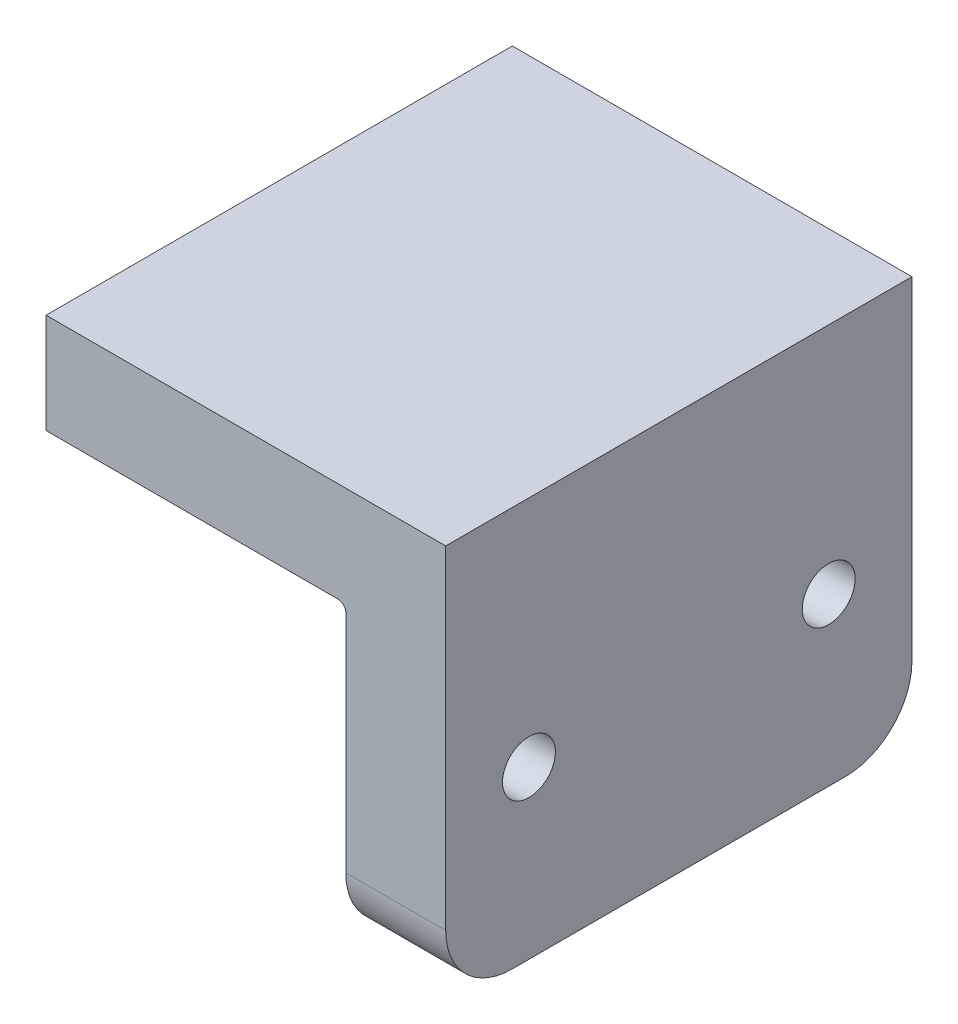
from build123d import *

# Parameters (mm, degrees)
EXTRUDE1_DEPTH                                   = 44.45
FILLET1_R                                        = 1.524
CBORE_FOR_3_8_SOCKET_HEAD_CAP_SCREW1_D           = 10.0838
CBORE_FOR_3_8_SOCKET_HEAD_CAP_SCREW1_CBORE_D     = 15.875
CBORE_FOR_3_8_SOCKET_HEAD_CAP_SCREW1_CBORE_DEPTH = 9.525
FILLET2_R                                        = 12.7
SKETCH4_W                                        = 2.645833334
SKETCH4_H                                        = 0.474893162
CUT_EXTRUDE1_DEPTH                               = 0.762
SKETCH5_W                                        = 11.248792
SKETCH5_H                                        = 37.761150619
EXTRUDE2_DEPTH                                   = 9.906


with BuildPart() as part:
    # Sketch1 → Extrude1 (new, symmetric)
    with BuildSketch(Plane.XY):
        Polygon((-76.2, 0), (-76.2, -19.05), (-19.05, -19.05), (-19.05, -76.2), (0, -76.2), (0, 0), align=None)
    extrude(amount=EXTRUDE1_DEPTH, both=True)

    # Fillet1
    fillet1_edges = [part.edges().sort_by_distance(p)[0] for p in [
        (-19.05, -19.05, 0),
    ]]
    fillet(fillet1_edges, radius=FILLET1_R)

    # CBORE for 3_8 Socket Head Cap Screw1 (through all)
    with Locations(Plane.ZY.offset(19.05)):
        with Locations((-28.575, -44.45), (28.575, -44.45)):
            CounterBoreHole(CBORE_FOR_3_8_SOCKET_HEAD_CAP_SCREW1_D / 2, CBORE_FOR_3_8_SOCKET_HEAD_CAP_SCREW1_CBORE_D / 2, CBORE_FOR_3_8_SOCKET_HEAD_CAP_SCREW1_CBORE_DEPTH)

    # Fillet2
    fillet2_edges = [part.edges().sort_by_distance(p)[0] for p in [
        (-9.525, -76.2, 44.45),
        (-9.525, -76.2, -44.45),
    ]]
    fillet(fillet2_edges, radius=FILLET2_R)

    # Sketch4 → Cut-Extrude1 (cut)
    # profile 1 of 27: a face of its own
    with BuildSketch(Plane.XZ.offset(76.2)):
        with BuildLine():
            Line((-11.817006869, -29.627642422), (-11.817006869, -29.097627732))
            add(Edge.make_bspline(
                [(-11.817006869, -29.097627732), (-11.816851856, -29.062997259), (-11.816552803, -28.996187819), (-11.812926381, -28.899843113), (-11.806427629, -28.810960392), (-11.798396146, -28.72956013), (-11.787136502, -28.655675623), (-11.774227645, -28.58921491), (-11.758502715, -28.530162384), (-11.739831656, -28.477857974), (-11.717838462, -28.430901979), (-11.694347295, -28.386518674), (-11.666502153, -28.345376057), (-11.63631017, -28.306508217), (-11.603143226, -28.270209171), (-11.567132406, -28.236209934), (-11.527754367, -28.204860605), (-11.485280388, -28.176357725), (-11.44057521, -28.150487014), (-11.393536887, -28.127888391), (-11.344096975, -28.109556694), (-11.292573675, -28.094178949), (-11.238969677, -28.081827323), (-11.18295519, -28.073605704), (-11.124921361, -28.068021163), (-11.085423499, -28.067528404), (-11.065446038, -28.067279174)],
                knots=[0, 0, 0, 0, 1.698787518, 3.27731721, 4.728409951, 6.070286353, 7.288646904, 8.393455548, 9.389990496, 10.283725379, 11.113616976, 11.931887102, 12.744353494, 13.547053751, 14.344590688, 15.153907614, 15.974148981, 16.810666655, 17.660988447, 18.506082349, 19.367288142, 20.244738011, 21.142497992, 22.06302001, 23.020302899, 24, 24, 24, 24], degree=3))
            add(Edge.make_bspline(
                [(-11.065446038, -28.067279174), (-11.04334545, -28.067639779), (-10.999915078, -28.068348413), (-10.936251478, -28.075295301), (-10.875554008, -28.087162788), (-10.817310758, -28.102672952), (-10.76248009, -28.124300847), (-10.709753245, -28.149009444), (-10.660610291, -28.179409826), (-10.614429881, -28.214143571), (-10.570861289, -28.252089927), (-10.531070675, -28.294088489), (-10.495069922, -28.339644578), (-10.461302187, -28.387493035), (-10.432471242, -28.439605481), (-10.40557821, -28.494157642), (-10.382790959, -28.552522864), (-10.370830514, -28.593134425), (-10.364766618, -28.61372432)],
                knots=[0, 0, 0, 0, 1.101964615, 2.165495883, 3.188506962, 4.184641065, 5.166448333, 6.124117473, 7.085225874, 8.042124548, 9.003636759, 9.963451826, 10.9225791, 11.897800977, 12.880319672, 13.889154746, 14.929810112, 16, 16, 16, 16], degree=3))
            add(Edge.make_bspline(
                [(-10.364766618, -28.61372432), (-10.361392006, -28.627287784), (-10.35408151, -28.656670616), (-10.346659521, -28.705291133), (-10.339835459, -28.761321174), (-10.333971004, -28.82494192), (-10.329984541, -28.89619005), (-10.32687129, -28.974996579), (-10.324607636, -29.061397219), (-10.324527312, -29.121476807), (-10.324485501, -29.15274926)],
                knots=[0, 0, 0, 0, 0.618981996, 1.340914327, 2.176866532, 3.120127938, 4.170906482, 5.338178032, 6.614476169, 8, 8, 8, 8], degree=3))
            Line((-10.324485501, -29.15274926), (-9.171173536, -29.15274926))
            Line((-9.171173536, -29.15274926), (-9.171173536, -29.627642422))
            Line((-9.171173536, -29.627642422), (-11.817006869, -29.627642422))
        make_face()
        with BuildLine():
            Line((-10.799378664, -29.15274926), (-10.799378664, -28.984734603))
            add(Edge.make_bspline(
                [(-10.799378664, -28.984734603), (-10.799572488, -28.954161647), (-10.799929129, -28.897906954), (-10.805087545, -28.821083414), (-10.812963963, -28.759345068), (-10.824264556, -28.710574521), (-10.841403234, -28.672054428), (-10.861264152, -28.638870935), (-10.886340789, -28.610172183), (-10.915477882, -28.585850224), (-10.948300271, -28.566086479), (-10.984720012, -28.552193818), (-11.024217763, -28.543433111), (-11.051794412, -28.542600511), (-11.065976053, -28.542172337)],
                knots=[0, 0, 0, 0, 1.862197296, 3.426470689, 4.686743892, 5.65255712, 6.462325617, 7.244961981, 8.000258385, 8.771939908, 9.549006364, 10.32248703, 11.137317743, 12, 12, 12, 12], degree=3))
            add(Edge.make_bspline(
                [(-11.065976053, -28.542172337), (-11.078369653, -28.542586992), (-11.102416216, -28.543391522), (-11.137096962, -28.549383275), (-11.169363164, -28.55868278), (-11.198765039, -28.572895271), (-11.225988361, -28.590150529), (-11.250185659, -28.612040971), (-11.272139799, -28.637285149), (-11.283745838, -28.656807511), (-11.289642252, -28.666725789)],
                knots=[0, 0, 0, 0, 1.102449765, 2.139017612, 3.12397484, 4.080535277, 5.035673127, 5.982361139, 6.974944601, 8, 8, 8, 8], degree=3))
            add(Edge.make_bspline(
                [(-11.289642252, -28.666725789), (-11.293889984, -28.67512502), (-11.302883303, -28.692907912), (-11.313338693, -28.723193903), (-11.322158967, -28.758143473), (-11.329479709, -28.797992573), (-11.335161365, -28.842582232), (-11.339506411, -28.891904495), (-11.341253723, -28.946031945), (-11.341819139, -28.983674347), (-11.342113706, -29.003285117)],
                knots=[0, 0, 0, 0, 0.656809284, 1.390599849, 2.23162475, 3.173112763, 4.218524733, 5.370385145, 6.63003504, 8, 8, 8, 8], degree=3))
            Line((-11.342113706, -29.003285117), (-11.342113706, -29.15274926))
            Line((-11.342113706, -29.15274926), (-10.799378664, -29.15274926))
        make_face(mode=Mode.SUBTRACT)
    # profile 2 of 27: a face of its own
    with BuildSketch(Plane.XZ.offset(76.2)):
        Polygon((-11.817006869, -26.743832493), (-11.817006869, -26.303390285), (-9.171173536, -25.23488067), (-9.171173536, -25.742104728), (-9.713908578, -25.947750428), (-9.713908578, -27.100532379), (-9.171173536, -27.306178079), (-9.171173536, -27.812872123), align=None)
        Polygon((-11.107317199, -26.523876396), (-10.188801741, -26.920327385), (-10.188801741, -26.127425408), align=None, mode=Mode.SUBTRACT)
    # profile 3 of 27: a face of its own
    with BuildSketch(Plane.XZ.offset(76.2)):
        with BuildLine():
            Line((-11.817006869, -24.844789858), (-11.817006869, -24.291454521))
            add(Edge.make_bspline(
                [(-11.817006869, -24.291454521), (-11.816878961, -24.254878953), (-11.816632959, -24.184533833), (-11.812668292, -24.083104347), (-11.807271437, -23.989912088), (-11.798630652, -23.904910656), (-11.788443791, -23.827893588), (-11.775165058, -23.759107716), (-11.760311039, -23.698336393), (-11.741727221, -23.64514125), (-11.720798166, -23.597119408), (-11.696679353, -23.552407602), (-11.66989094, -23.509685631), (-11.638698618, -23.470330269), (-11.605885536, -23.432040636), (-11.569238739, -23.396701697), (-11.52939481, -23.363706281), (-11.486361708, -23.333650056), (-11.441048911, -23.306010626), (-11.393292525, -23.282235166), (-11.343481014, -23.261964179), (-11.291859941, -23.244931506), (-11.237914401, -23.2322319), (-11.182259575, -23.223535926), (-11.124601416, -23.21713773), (-11.085428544, -23.216771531), (-11.065446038, -23.21658473)],
                knots=[0, 0, 0, 0, 1.748890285, 3.363608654, 4.853419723, 6.211897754, 7.448506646, 8.566916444, 9.560702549, 10.437053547, 11.257979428, 12.063058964, 12.86458444, 13.665575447, 14.461919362, 15.274455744, 16.096554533, 16.933325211, 17.78237398, 18.632472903, 19.481227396, 20.352186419, 21.229229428, 22.127857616, 23.044999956, 24, 24, 24, 24], degree=3))
            add(Edge.make_bspline(
                [(-11.065446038, -23.21658473), (-11.044589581, -23.217073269), (-11.003693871, -23.218031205), (-10.943613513, -23.223148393), (-10.885993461, -23.232661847), (-10.831203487, -23.246601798), (-10.778682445, -23.263287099), (-10.729250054, -23.284896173), (-10.682031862, -23.309469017), (-10.63780598, -23.338620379), (-10.595621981, -23.370632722), (-10.557011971, -23.407811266), (-10.52014568, -23.448055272), (-10.486278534, -23.492589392), (-10.455621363, -23.541280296), (-10.426928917, -23.5932124), (-10.400710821, -23.649103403), (-10.386046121, -23.688362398), (-10.378547, -23.708438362)],
                knots=[0, 0, 0, 0, 1.099808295, 2.156523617, 3.176426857, 4.17500812, 5.135317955, 6.078349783, 7.015890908, 7.9382699, 8.868004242, 9.803692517, 10.759882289, 11.743580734, 12.748787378, 13.791075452, 14.870417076, 16, 16, 16, 16], degree=3))
            Line((-10.378547, -23.708438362), (-9.171173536, -23.097861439))
            Line((-9.171173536, -23.097861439), (-9.171173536, -23.625756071))
            Line((-9.171173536, -23.625756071), (-10.324485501, -24.20877223))
            Line((-10.324485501, -24.20877223), (-10.324485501, -24.369896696))
            Line((-10.324485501, -24.369896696), (-9.171173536, -24.369896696))
            Line((-9.171173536, -24.369896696), (-9.171173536, -24.844789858))
            Line((-9.171173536, -24.844789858), (-11.817006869, -24.844789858))
        make_face()
        with BuildLine():
            Line((-10.799378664, -24.369896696), (-10.799378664, -24.184921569))
            add(Edge.make_bspline(
                [(-10.799378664, -24.184921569), (-10.799633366, -24.162306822), (-10.800121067, -24.119004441), (-10.802383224, -24.05672993), (-10.807833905, -24.000169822), (-10.814720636, -23.949081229), (-10.822672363, -23.903207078), (-10.834067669, -23.862956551), (-10.846278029, -23.827709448), (-10.861452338, -23.797883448), (-10.878708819, -23.772400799), (-10.89831261, -23.750398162), (-10.921001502, -23.732198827), (-10.946158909, -23.717219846), (-10.974007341, -23.705567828), (-11.004241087, -23.697062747), (-11.037204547, -23.692309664), (-11.059953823, -23.691762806), (-11.071806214, -23.691477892)],
                knots=[0, 0, 0, 0, 1.688639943, 3.233382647, 4.650958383, 5.928841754, 7.082724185, 8.122798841, 9.049171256, 9.863274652, 10.613301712, 11.341792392, 12.054588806, 12.776240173, 13.521029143, 14.301969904, 15.115324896, 16, 16, 16, 16], degree=3))
            add(Edge.make_bspline(
                [(-11.071806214, -23.691477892), (-11.085836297, -23.691990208), (-11.113224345, -23.692990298), (-11.152764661, -23.703803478), (-11.189626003, -23.7201205), (-11.223308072, -23.743215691), (-11.252747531, -23.772045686), (-11.278754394, -23.805139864), (-11.299089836, -23.843359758), (-11.313369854, -23.878400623), (-11.321385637, -23.910582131), (-11.327404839, -23.939525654), (-11.331877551, -23.97301298), (-11.335498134, -24.0112138), (-11.338729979, -24.053790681), (-11.340786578, -24.101160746), (-11.341692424, -24.153117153), (-11.341969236, -24.189338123), (-11.342113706, -24.208242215)],
                knots=[0, 0, 0, 0, 1.020140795, 1.991411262, 2.965409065, 3.947543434, 4.949233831, 5.95883764, 7.001880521, 8.094604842, 8.706727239, 9.41631554, 10.248493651, 11.167128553, 12.212949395, 13.360078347, 14.622198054, 16, 16, 16, 16], degree=3))
            Line((-11.342113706, -24.208242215), (-11.342113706, -24.369896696))
            Line((-11.342113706, -24.369896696), (-10.799378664, -24.369896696))
        make_face(mode=Mode.SUBTRACT)
    # profile 4 of 27: a face of its own
    with BuildSketch(Plane.XZ.offset(76.2)):
        Polygon((-11.817006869, -22.979138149), (-11.817006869, -21.554458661), (-11.342113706, -21.554458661), (-11.342113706, -22.029351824), (-9.171173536, -22.029351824), (-9.171173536, -22.504244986), (-11.342113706, -22.504244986), (-11.342113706, -22.979138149), align=None)
    # profile 5 of 27: a face of its own
    with BuildSketch(Plane.XZ.offset(76.2)):
        Polygon((-11.817006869, -20.163700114), (-11.817006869, -19.735978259), (-10.075908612, -18.535494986), (-11.817006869, -18.535494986), (-11.817006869, -18.060601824), (-9.171173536, -18.060601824), (-9.171173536, -18.491503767), (-10.906971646, -19.688806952), (-9.171173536, -19.688806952), (-9.171173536, -20.163700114), align=None)
    # profile 6 of 27: a face of its own
    with BuildSketch(Plane.XZ.offset(76.2)):
        with BuildLine():
            Line((-11.817006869, -17.450024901), (-11.817006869, -16.975131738))
            Line((-11.817006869, -16.975131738), (-10.095519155, -16.975131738))
            add(Edge.make_bspline(
                [(-10.095519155, -16.975131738), (-10.07767164, -16.975104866), (-10.04319935, -16.975052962), (-9.99374092, -16.972570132), (-9.948109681, -16.970230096), (-9.906675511, -16.966248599), (-9.869309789, -16.960003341), (-9.835874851, -16.954172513), (-9.806668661, -16.946178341), (-9.773401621, -16.934207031), (-9.736029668, -16.915517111), (-9.696638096, -16.885873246), (-9.661576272, -16.850473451), (-9.632136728, -16.808784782), (-9.607236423, -16.762240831), (-9.590766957, -16.709924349), (-9.579596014, -16.653536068), (-9.578690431, -16.614250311), (-9.578224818, -16.594051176)],
                knots=[0, 0, 0, 0, 1.155195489, 2.231248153, 3.20507519, 4.113220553, 4.92363642, 5.657123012, 6.309133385, 6.880755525, 7.944644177, 8.999147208, 10.058600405, 11.156792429, 12.29246015, 13.460660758, 14.694375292, 16, 16, 16, 16], degree=3))
            add(Edge.make_bspline(
                [(-9.578224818, -16.594051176), (-9.57885033, -16.572615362), (-9.580069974, -16.530819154), (-9.592042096, -16.470701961), (-9.611105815, -16.415003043), (-9.638314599, -16.364901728), (-9.670929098, -16.320447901), (-9.708119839, -16.282818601), (-9.749961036, -16.253121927), (-9.788562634, -16.233766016), (-9.824092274, -16.222900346), (-9.85583586, -16.214749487), (-9.893120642, -16.208830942), (-9.935687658, -16.203289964), (-9.983847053, -16.200148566), (-10.037347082, -16.196570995), (-10.096220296, -16.195288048), (-10.137213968, -16.195065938), (-10.158590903, -16.194950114)],
                knots=[0, 0, 0, 0, 1.26131785, 2.459356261, 3.594833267, 4.716926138, 5.803419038, 6.833631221, 7.818372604, 8.814377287, 9.360705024, 10.004324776, 10.743421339, 11.582437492, 12.532246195, 13.585177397, 14.740744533, 16, 16, 16, 16], degree=3))
            Line((-10.158590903, -16.194950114), (-11.817006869, -16.194950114))
            Line((-11.817006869, -16.194950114), (-11.817006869, -15.720056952))
            Line((-11.817006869, -15.720056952), (-10.238623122, -15.720056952))
            add(Edge.make_bspline(
                [(-10.238623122, -15.720056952), (-10.206645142, -15.720122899), (-10.145154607, -15.72024971), (-10.05678838, -15.72219714), (-9.976080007, -15.726342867), (-9.903005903, -15.729824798), (-9.837664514, -15.73656353), (-9.779776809, -15.743583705), (-9.729547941, -15.752531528), (-9.672368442, -15.765845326), (-9.60652858, -15.788821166), (-9.530715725, -15.825860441), (-9.45649467, -15.872882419), (-9.38466043, -15.928448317), (-9.317992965, -15.991231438), (-9.259301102, -16.059566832), (-9.210465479, -16.133141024), (-9.17097964, -16.21161417), (-9.140575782, -16.295814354), (-9.119085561, -16.385940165), (-9.105410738, -16.482507), (-9.104038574, -16.549128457), (-9.103331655, -16.583450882)],
                knots=[0, 0, 0, 0, 1.170930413, 2.251584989, 3.235934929, 4.130173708, 4.929654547, 5.640582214, 6.264911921, 6.796838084, 7.789064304, 8.810388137, 9.880124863, 11.000704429, 12.131026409, 13.227749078, 14.29171941, 15.356377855, 16.43689688, 17.561893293, 18.743922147, 20, 20, 20, 20], degree=3))
            add(Edge.make_bspline(
                [(-9.103331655, -16.583450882), (-9.10371692, -16.60625802), (-9.104477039, -16.651256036), (-9.111144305, -16.717439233), (-9.121050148, -16.781396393), (-9.135221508, -16.843161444), (-9.154566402, -16.902521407), (-9.17742735, -16.959860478), (-9.203584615, -17.015386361), (-9.235329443, -17.067363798), (-9.268673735, -17.117069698), (-9.305157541, -17.162836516), (-9.343162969, -17.205367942), (-9.383559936, -17.244169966), (-9.426060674, -17.279278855), (-9.470706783, -17.310667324), (-9.517508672, -17.338276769), (-9.567306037, -17.362805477), (-9.622631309, -17.383797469), (-9.685450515, -17.401503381), (-9.756584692, -17.41689552), (-9.836502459, -17.428547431), (-9.924839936, -17.438817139), (-10.021934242, -17.445471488), (-10.127471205, -17.448906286), (-10.200636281, -17.449642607), (-10.238623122, -17.450024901)],
                knots=[0, 0, 0, 0, 1.001237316, 1.975420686, 2.917953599, 3.841913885, 4.754568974, 5.656377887, 6.55158913, 7.445656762, 8.327865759, 9.178398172, 10.013362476, 10.830881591, 11.635451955, 12.431789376, 13.224756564, 14.019278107, 14.866442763, 15.819105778, 16.882716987, 18.059987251, 19.363897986, 20.787153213, 22.331910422, 24, 24, 24, 24], degree=3))
            Line((-10.238623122, -17.450024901), (-11.817006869, -17.450024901))
        make_face()
    # profile 7 of 27: a face of its own
    with BuildSketch(Plane.XZ.offset(76.2)):
        Polygon((-11.817006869, -14.900124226), (-11.817006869, -14.407210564), (-9.971495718, -13.803523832), (-11.817006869, -13.195596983), (-11.817006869, -12.707453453), (-9.171173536, -12.260121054), (-9.171173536, -12.740844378), (-10.842309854, -13.023342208), (-9.171173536, -13.573497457), (-9.171173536, -14.036730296), (-10.842309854, -14.583705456), (-9.171173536, -14.865673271), (-9.171173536, -15.34692661), align=None)
    # profile 8 of 27: a face of its own
    with BuildSketch(Plane.XZ.offset(76.2)):
        with BuildLine():
            Line((-9.171173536, -11.819148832), (-11.817006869, -11.819148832))
            Line((-11.817006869, -11.819148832), (-11.817006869, -11.39513708))
            add(Edge.make_bspline(
                [(-11.817006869, -11.39513708), (-11.817010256, -11.365453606), (-11.817016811, -11.308016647), (-11.814106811, -11.225150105), (-11.810342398, -11.148298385), (-11.806130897, -11.07770606), (-11.798873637, -11.013252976), (-11.791225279, -10.955037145), (-11.78200183, -10.902942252), (-11.773728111, -10.87073481), (-11.769835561, -10.855582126)],
                knots=[0, 0, 0, 0, 1.311965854, 2.538629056, 3.664479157, 4.713267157, 5.663616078, 6.530575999, 7.308677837, 8, 8, 8, 8], degree=3))
            add(Edge.make_bspline(
                [(-11.769835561, -10.855582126), (-11.764344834, -10.835685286), (-11.753570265, -10.796641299), (-11.731814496, -10.740714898), (-11.707616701, -10.687672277), (-11.680065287, -10.637524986), (-11.648646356, -10.590866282), (-11.61395941, -10.547055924), (-11.575991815, -10.506300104), (-11.534521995, -10.469239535), (-11.490629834, -10.435814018), (-11.444340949, -10.406559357), (-11.39616147, -10.381602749), (-11.345988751, -10.361224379), (-11.293885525, -10.346021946), (-11.240016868, -10.334874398), (-11.184188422, -10.327656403), (-11.146207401, -10.326973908), (-11.126927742, -10.326627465)],
                knots=[0, 0, 0, 0, 1.099825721, 2.158211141, 3.195041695, 4.206926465, 5.204905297, 6.190538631, 7.183526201, 8.170733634, 9.152262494, 10.121785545, 11.086538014, 12.041584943, 13.004265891, 13.975982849, 14.972582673, 16, 16, 16, 16], degree=3))
            add(Edge.make_bspline(
                [(-11.126927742, -10.326627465), (-11.102157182, -10.327530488), (-11.053399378, -10.32930798), (-10.981802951, -10.340728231), (-10.914211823, -10.361900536), (-10.849436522, -10.390285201), (-10.787078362, -10.42776668), (-10.727912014, -10.476230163), (-10.66989471, -10.53388863), (-10.635134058, -10.578151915), (-10.61705361, -10.601175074)],
                knots=[0, 0, 0, 0, 0.986208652, 1.941230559, 2.875571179, 3.798165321, 4.751009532, 5.761494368, 6.83566093, 8, 8, 8, 8], degree=3))
            add(Edge.make_bspline(
                [(-10.61705361, -10.601175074), (-10.607531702, -10.582519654), (-10.588861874, -10.545941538), (-10.558156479, -10.494027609), (-10.525564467, -10.445899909), (-10.491512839, -10.401719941), (-10.455490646, -10.361215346), (-10.417616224, -10.325033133), (-10.378075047, -10.292240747), (-10.336594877, -10.263482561), (-10.292962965, -10.238692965), (-10.247818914, -10.216883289), (-10.200761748, -10.198107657), (-10.151689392, -10.182850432), (-10.10066396, -10.171077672), (-10.047803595, -10.163518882), (-9.993177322, -10.157702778), (-9.955965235, -10.157251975), (-9.937044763, -10.157022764)],
                knots=[0, 0, 0, 0, 1.164539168, 2.28333912, 3.351515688, 4.395009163, 5.383055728, 6.362812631, 7.305003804, 8.237049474, 9.165619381, 10.092784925, 11.02322402, 11.98030579, 12.947919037, 13.931657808, 14.948352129, 16, 16, 16, 16], degree=3))
            add(Edge.make_bspline(
                [(-9.937044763, -10.157022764), (-9.900907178, -10.158511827), (-9.829589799, -10.161450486), (-9.724895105, -10.182988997), (-9.625719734, -10.220130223), (-9.532586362, -10.270481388), (-9.447777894, -10.332212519), (-9.37287948, -10.402812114), (-9.309949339, -10.482493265), (-9.267421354, -10.555786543), (-9.238927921, -10.619211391), (-9.221230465, -10.67172528), (-9.205159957, -10.728225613), (-9.192585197, -10.789353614), (-9.183240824, -10.854690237), (-9.176425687, -10.924192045), (-9.172129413, -10.9981027), (-9.171498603, -11.048854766), (-9.171173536, -11.075008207)],
                knots=[0, 0, 0, 0, 1.284195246, 2.534354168, 3.78027825, 5.036354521, 6.286276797, 7.499025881, 8.683874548, 9.882754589, 10.501292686, 11.152751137, 11.850656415, 12.588451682, 13.369156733, 14.195917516, 15.070324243, 16, 16, 16, 16], degree=3))
            Line((-9.171173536, -11.075008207), (-9.171173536, -11.819148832))
        make_face()
        with BuildLine():
            Line((-11.342113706, -11.34425567), (-10.765457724, -11.34425567))
            Line((-10.765457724, -11.34425567), (-10.765457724, -11.218112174))
            add(Edge.make_bspline(
                [(-10.765457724, -11.218112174), (-10.765607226, -11.200968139), (-10.765895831, -11.167872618), (-10.76961297, -11.120069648), (-10.775954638, -11.075620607), (-10.784802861, -11.034694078), (-10.796038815, -10.996908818), (-10.809558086, -10.962506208), (-10.826053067, -10.931637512), (-10.850623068, -10.895775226), (-10.886778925, -10.857866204), (-10.939013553, -10.824495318), (-10.999083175, -10.804840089), (-11.041448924, -10.802651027), (-11.063325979, -10.801520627)],
                knots=[0, 0, 0, 0, 1.065314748, 2.056525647, 2.977365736, 3.853934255, 4.656397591, 5.425096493, 6.14721249, 6.826394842, 8.123232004, 9.372140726, 10.643011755, 12, 12, 12, 12], degree=3))
            add(Edge.make_bspline(
                [(-11.063325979, -10.801520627), (-11.083817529, -10.80242514), (-11.123437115, -10.804173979), (-11.179065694, -10.823964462), (-11.228367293, -10.854701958), (-11.262099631, -10.890995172), (-11.285162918, -10.925164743), (-11.300272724, -10.954444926), (-11.314095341, -10.986445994), (-11.323418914, -11.022319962), (-11.332338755, -11.060916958), (-11.337734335, -11.102983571), (-11.34172652, -11.148072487), (-11.341981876, -11.179234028), (-11.342113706, -11.195321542)],
                knots=[0, 0, 0, 0, 1.348076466, 2.606451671, 3.849585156, 5.153713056, 5.843081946, 6.568636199, 7.327130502, 8.139792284, 9.011860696, 9.942616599, 10.937851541, 12, 12, 12, 12], degree=3))
            Line((-11.342113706, -11.195321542), (-11.342113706, -11.34425567))
        make_face(mode=Mode.SUBTRACT)
        with BuildLine():
            Line((-10.324485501, -11.34425567), (-9.646066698, -11.34425567))
            Line((-9.646066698, -11.34425567), (-9.646066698, -11.20751188))
            add(Edge.make_bspline(
                [(-9.646066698, -11.20751188), (-9.646223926, -11.180478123), (-9.646526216, -11.128502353), (-9.650077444, -11.054036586), (-9.656664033, -10.986365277), (-9.664354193, -10.925472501), (-9.676513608, -10.871856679), (-9.689156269, -10.824538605), (-9.705418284, -10.784338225), (-9.724276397, -10.750569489), (-9.745608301, -10.722327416), (-9.768694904, -10.697871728), (-9.794491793, -10.677473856), (-9.822428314, -10.661069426), (-9.852246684, -10.647289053), (-9.884936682, -10.638847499), (-9.919481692, -10.632450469), (-9.943372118, -10.63209685), (-9.955595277, -10.631915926)],
                knots=[0, 0, 0, 0, 1.753677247, 3.371663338, 4.833688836, 6.164395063, 7.349095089, 8.3975697, 9.338276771, 10.154261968, 10.899224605, 11.628775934, 12.330426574, 13.024264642, 13.727131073, 14.452891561, 15.208446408, 16, 16, 16, 16], degree=3))
            add(Edge.make_bspline(
                [(-9.955595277, -10.631915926), (-9.969573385, -10.632313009), (-9.996798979, -10.633086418), (-10.036585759, -10.639421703), (-10.073753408, -10.650887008), (-10.109278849, -10.66554296), (-10.142145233, -10.685369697), (-10.17285252, -10.709518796), (-10.200658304, -10.738421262), (-10.227188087, -10.770992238), (-10.250608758, -10.808796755), (-10.270010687, -10.852470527), (-10.287078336, -10.901352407), (-10.300436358, -10.956262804), (-10.311853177, -11.016711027), (-10.318651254, -11.083193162), (-10.323713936, -11.155138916), (-10.324222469, -11.205028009), (-10.324485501, -11.230832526)],
                knots=[0, 0, 0, 0, 0.844975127, 1.645784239, 2.426462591, 3.192310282, 3.963577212, 4.739343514, 5.547598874, 6.383408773, 7.27567655, 8.226932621, 9.267447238, 10.402227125, 11.640487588, 12.984111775, 14.440069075, 16, 16, 16, 16], degree=3))
            Line((-10.324485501, -11.230832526), (-10.324485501, -11.34425567))
        make_face(mode=Mode.SUBTRACT)
    # profile 9 of 27: a face of its own
    with BuildSketch(Plane.XZ.offset(76.2)):
        Polygon((-11.817006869, -9.682129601), (-11.817006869, -8.257450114), (-11.342113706, -8.257450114), (-11.342113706, -9.207236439), (-10.833299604, -9.207236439), (-10.833299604, -8.257450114), (-10.358406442, -8.257450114), (-10.358406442, -9.207236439), (-9.646066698, -9.207236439), (-9.646066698, -8.257450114), (-9.171173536, -8.257450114), (-9.171173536, -9.682129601), align=None)
    # profile 10 of 27: a face of its own
    with BuildSketch(Plane.XZ.offset(76.2)):
        with BuildLine():
            Line((-11.817006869, -7.782556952), (-11.817006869, -7.229221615))
            add(Edge.make_bspline(
                [(-11.817006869, -7.229221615), (-11.816878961, -7.192646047), (-11.816632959, -7.122300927), (-11.812668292, -7.020871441), (-11.807271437, -6.927679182), (-11.798630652, -6.84267775), (-11.788443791, -6.765660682), (-11.775165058, -6.69687481), (-11.760311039, -6.636103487), (-11.741727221, -6.582908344), (-11.720798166, -6.534886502), (-11.696679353, -6.490174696), (-11.66989094, -6.447452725), (-11.638698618, -6.408097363), (-11.605885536, -6.36980773), (-11.569238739, -6.334468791), (-11.52939481, -6.301473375), (-11.486361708, -6.27141715), (-11.441048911, -6.24377772), (-11.393292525, -6.22000226), (-11.343481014, -6.199731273), (-11.291859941, -6.1826986), (-11.237914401, -6.169998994), (-11.182259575, -6.16130302), (-11.124601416, -6.154904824), (-11.085428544, -6.154538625), (-11.065446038, -6.154351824)],
                knots=[0, 0, 0, 0, 1.748890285, 3.363608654, 4.853419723, 6.211897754, 7.448506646, 8.566916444, 9.560702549, 10.437053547, 11.257979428, 12.063058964, 12.86458444, 13.665575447, 14.461919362, 15.274455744, 16.096554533, 16.933325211, 17.78237398, 18.632472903, 19.481227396, 20.352186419, 21.229229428, 22.127857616, 23.044999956, 24, 24, 24, 24], degree=3))
            add(Edge.make_bspline(
                [(-11.065446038, -6.154351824), (-11.044589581, -6.154840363), (-11.003693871, -6.155798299), (-10.943613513, -6.160915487), (-10.885993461, -6.170428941), (-10.831203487, -6.184368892), (-10.778682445, -6.201054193), (-10.729250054, -6.222663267), (-10.682031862, -6.247236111), (-10.63780598, -6.276387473), (-10.595621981, -6.308399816), (-10.557011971, -6.34557836), (-10.52014568, -6.385822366), (-10.486278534, -6.430356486), (-10.455621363, -6.47904739), (-10.426928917, -6.530979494), (-10.400710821, -6.586870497), (-10.386046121, -6.626129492), (-10.378547, -6.646205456)],
                knots=[0, 0, 0, 0, 1.099808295, 2.156523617, 3.176426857, 4.17500812, 5.135317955, 6.078349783, 7.015890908, 7.9382699, 8.868004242, 9.803692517, 10.759882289, 11.743580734, 12.748787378, 13.791075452, 14.870417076, 16, 16, 16, 16], degree=3))
            Line((-10.378547, -6.646205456), (-9.171173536, -6.035628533))
            Line((-9.171173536, -6.035628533), (-9.171173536, -6.563523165))
            Line((-9.171173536, -6.563523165), (-10.324485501, -7.146539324))
            Line((-10.324485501, -7.146539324), (-10.324485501, -7.30766379))
            Line((-10.324485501, -7.30766379), (-9.171173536, -7.30766379))
            Line((-9.171173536, -7.30766379), (-9.171173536, -7.782556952))
            Line((-9.171173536, -7.782556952), (-11.817006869, -7.782556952))
        make_face()
        with BuildLine():
            Line((-10.799378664, -7.30766379), (-10.799378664, -7.122688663))
            add(Edge.make_bspline(
                [(-10.799378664, -7.122688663), (-10.799633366, -7.100073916), (-10.800121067, -7.056771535), (-10.802383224, -6.994497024), (-10.807833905, -6.937936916), (-10.814720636, -6.886848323), (-10.822672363, -6.840974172), (-10.834067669, -6.800723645), (-10.846278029, -6.765476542), (-10.861452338, -6.735650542), (-10.878708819, -6.710167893), (-10.89831261, -6.688165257), (-10.921001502, -6.669965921), (-10.946158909, -6.65498694), (-10.974007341, -6.643334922), (-11.004241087, -6.634829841), (-11.037204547, -6.630076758), (-11.059953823, -6.6295299), (-11.071806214, -6.629244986)],
                knots=[0, 0, 0, 0, 1.688639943, 3.233382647, 4.650958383, 5.928841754, 7.082724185, 8.122798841, 9.049171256, 9.863274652, 10.613301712, 11.341792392, 12.054588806, 12.776240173, 13.521029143, 14.301969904, 15.115324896, 16, 16, 16, 16], degree=3))
            add(Edge.make_bspline(
                [(-11.071806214, -6.629244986), (-11.085836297, -6.629757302), (-11.113224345, -6.630757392), (-11.152764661, -6.641570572), (-11.189626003, -6.657887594), (-11.223308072, -6.680982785), (-11.252747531, -6.70981278), (-11.278754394, -6.742906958), (-11.299089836, -6.781126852), (-11.313369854, -6.816167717), (-11.321385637, -6.848349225), (-11.327404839, -6.877292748), (-11.331877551, -6.910780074), (-11.335498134, -6.948980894), (-11.338729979, -6.991557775), (-11.340786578, -7.03892784), (-11.341692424, -7.090884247), (-11.341969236, -7.127105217), (-11.342113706, -7.146009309)],
                knots=[0, 0, 0, 0, 1.020140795, 1.991411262, 2.965409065, 3.947543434, 4.949233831, 5.95883764, 7.001880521, 8.094604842, 8.706727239, 9.41631554, 10.248493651, 11.167128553, 12.212949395, 13.360078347, 14.622198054, 16, 16, 16, 16], degree=3))
            Line((-11.342113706, -7.146009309), (-11.342113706, -7.30766379))
            Line((-11.342113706, -7.30766379), (-10.799378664, -7.30766379))
        make_face(mode=Mode.SUBTRACT)
    # profile 11 of 27: a face of its own
    with BuildSketch(Plane.XZ.offset(76.2)):
        Polygon((-11.817006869, -4.344351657), (-11.817006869, -3.610281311), (-9.171173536, -3.610281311), (-9.171173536, -4.085174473), (-11.376034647, -4.085174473), (-11.376034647, -4.627909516), align=None)
    # profile 12 of 27: a face of its own
    with BuildSketch(Plane.XZ.offset(76.2)):
        with BuildLine():
            Line((-10.935062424, -2.253443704), (-10.935062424, -2.728336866))
            add(Edge.make_bspline(
                [(-10.935062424, -2.728336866), (-10.970985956, -2.726286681), (-11.041178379, -2.722280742), (-11.143128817, -2.70632865), (-11.239484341, -2.685008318), (-11.329955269, -2.656310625), (-11.414579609, -2.620962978), (-11.493077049, -2.578085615), (-11.56601006, -2.528958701), (-11.632099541, -2.472591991), (-11.691515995, -2.411273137), (-11.743459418, -2.345159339), (-11.786942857, -2.274438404), (-11.82261252, -2.199583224), (-11.851152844, -2.120887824), (-11.870224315, -2.037557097), (-11.883142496, -1.950326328), (-11.884272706, -1.890609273), (-11.884848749, -1.860172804)],
                knots=[0, 0, 0, 0, 1.198928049, 2.342633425, 3.435730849, 4.486331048, 5.502589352, 6.488331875, 7.46361919, 8.428949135, 9.378681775, 10.305958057, 11.226249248, 12.140413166, 13.066341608, 14.010670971, 14.986082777, 16, 16, 16, 16], degree=3))
            add(Edge.make_bspline(
                [(-11.884848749, -1.860172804), (-11.883761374, -1.822795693), (-11.881637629, -1.749794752), (-11.861127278, -1.644071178), (-11.829719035, -1.544802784), (-11.784087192, -1.453045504), (-11.726545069, -1.36895887), (-11.657801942, -1.293010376), (-11.577022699, -1.226681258), (-11.486533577, -1.170488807), (-11.390526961, -1.124020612), (-11.291433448, -1.091145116), (-11.191810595, -1.069650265), (-11.12473755, -1.06735236), (-11.091416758, -1.066210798)],
                knots=[0, 0, 0, 0, 1.075374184, 2.100304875, 3.089917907, 4.066149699, 5.039978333, 6.01615708, 7.006437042, 8.039858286, 9.077679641, 10.07047942, 11.041445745, 12, 12, 12, 12], degree=3))
            add(Edge.make_bspline(
                [(-11.091416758, -1.066210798), (-11.0712616, -1.066654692), (-11.030694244, -1.06754814), (-10.969305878, -1.073760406), (-10.906774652, -1.083080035), (-10.843154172, -1.097131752), (-10.778426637, -1.114655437), (-10.71239821, -1.135914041), (-10.64544376, -1.161401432), (-10.576807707, -1.190689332), (-10.50627531, -1.225639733), (-10.432755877, -1.266294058), (-10.356327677, -1.314011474), (-10.276241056, -1.367238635), (-10.193718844, -1.42806951), (-10.107844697, -1.494892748), (-10.01875393, -1.568044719), (-9.959174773, -1.6199231), (-9.928564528, -1.646576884)],
                knots=[0, 0, 0, 0, 0.728277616, 1.465842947, 2.227925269, 3.011838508, 3.818735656, 4.650581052, 5.517389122, 6.406849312, 7.346234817, 8.360743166, 9.441530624, 10.601362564, 11.834937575, 13.145232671, 14.533293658, 16, 16, 16, 16], degree=3))
            Line((-9.928564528, -1.646576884), (-9.612145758, -1.922714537))
            Line((-9.612145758, -1.922714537), (-9.612145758, -1.032289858))
            Line((-9.612145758, -1.032289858), (-9.171173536, -1.032289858))
            Line((-9.171173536, -1.032289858), (-9.171173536, -2.796178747))
            Line((-9.171173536, -2.796178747), (-9.411800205, -2.796178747))
            Line((-9.411800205, -2.796178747), (-10.245513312, -2.012817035))
            add(Edge.make_bspline(
                [(-10.245513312, -2.012817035), (-10.269832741, -1.990136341), (-10.316932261, -1.946210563), (-10.38610687, -1.883714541), (-10.451737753, -1.827140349), (-10.514586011, -1.777752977), (-10.572523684, -1.732564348), (-10.627741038, -1.694760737), (-10.678683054, -1.661838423), (-10.740779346, -1.627447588), (-10.814280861, -1.594035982), (-10.898905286, -1.563398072), (-10.979843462, -1.544909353), (-11.032678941, -1.542337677), (-11.058025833, -1.54110396)],
                knots=[0, 0, 0, 0, 1.246192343, 2.413505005, 3.49357156, 4.492416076, 5.408771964, 6.246246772, 6.999304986, 7.680960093, 8.904522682, 10.020616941, 11.0504258, 12, 12, 12, 12], degree=3))
            add(Edge.make_bspline(
                [(-11.058025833, -1.54110396), (-11.082547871, -1.542023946), (-11.130063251, -1.543806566), (-11.197653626, -1.563396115), (-11.258849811, -1.593744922), (-11.311823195, -1.636510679), (-11.355354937, -1.688313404), (-11.387732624, -1.748176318), (-11.406414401, -1.815611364), (-11.408752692, -1.862884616), (-11.409955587, -1.887203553)],
                knots=[0, 0, 0, 0, 1.062038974, 2.057870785, 3.028805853, 4.01125022, 4.991535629, 5.949134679, 6.94496649, 8, 8, 8, 8], degree=3))
            add(Edge.make_bspline(
                [(-11.409955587, -1.887203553), (-11.409511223, -1.899767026), (-11.408636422, -1.924500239), (-11.402813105, -1.96085613), (-11.392550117, -1.995451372), (-11.378799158, -2.02867103), (-11.360572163, -2.060160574), (-11.338104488, -2.089840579), (-11.311967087, -2.118023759), (-11.282241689, -2.144580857), (-11.249068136, -2.168751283), (-11.2127494, -2.190219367), (-11.173308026, -2.207969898), (-11.131264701, -2.223598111), (-11.086167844, -2.235651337), (-11.038287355, -2.24442758), (-10.98770113, -2.251099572), (-10.952927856, -2.252648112), (-10.935062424, -2.253443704)],
                knots=[0, 0, 0, 0, 0.903469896, 1.778625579, 2.63899355, 3.493148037, 4.358286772, 5.247621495, 6.164656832, 7.118446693, 8.109501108, 9.111810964, 10.146451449, 11.215617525, 12.33435995, 13.498009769, 14.714554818, 16, 16, 16, 16], degree=3))
        make_face()
    # profile 13 of 27: a face of its own
    with BuildSketch(Plane.XZ.offset(76.2)):
        with BuildLine():
            Line((-11.172509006, -0.082503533), (-11.172509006, -0.557396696))
            add(Edge.make_bspline(
                [(-11.172509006, -0.557396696), (-11.196252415, -0.554064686), (-11.242629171, -0.547556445), (-11.309931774, -0.531557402), (-11.373931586, -0.513055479), (-11.434285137, -0.489394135), (-11.490927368, -0.462081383), (-11.543908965, -0.430231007), (-11.593990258, -0.395320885), (-11.624002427, -0.367988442), (-11.638921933, -0.354401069)],
                knots=[0, 0, 0, 0, 1.1115466, 2.171125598, 3.205689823, 4.19946166, 5.17440286, 6.118867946, 7.064860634, 8, 8, 8, 8], degree=3))
            add(Edge.make_bspline(
                [(-11.638921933, -0.354401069), (-11.658637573, -0.334851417), (-11.697495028, -0.296321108), (-11.747267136, -0.231932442), (-11.79034151, -0.164441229), (-11.824491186, -0.092493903), (-11.852131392, -0.017210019), (-11.870697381, 0.062009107), (-11.883016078, 0.144839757), (-11.884229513, 0.201361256), (-11.884848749, 0.230205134)],
                knots=[0, 0, 0, 0, 1.01925491, 2.00884431, 2.983262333, 3.955970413, 4.92937149, 5.924503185, 6.940838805, 8, 8, 8, 8], degree=3))
            add(Edge.make_bspline(
                [(-11.884848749, 0.230205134), (-11.884243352, 0.255848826), (-11.883053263, 0.306259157), (-11.873499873, 0.38034966), (-11.856744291, 0.450988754), (-11.834836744, 0.518923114), (-11.805027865, 0.583153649), (-11.7704261, 0.645097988), (-11.727985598, 0.703025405), (-11.680032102, 0.757071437), (-11.628165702, 0.806723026), (-11.572724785, 0.849721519), (-11.515190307, 0.886688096), (-11.455084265, 0.917143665), (-11.392304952, 0.940559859), (-11.327215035, 0.956811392), (-11.259958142, 0.967448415), (-11.214244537, 0.968508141), (-11.19105952, 0.969045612)],
                knots=[0, 0, 0, 0, 1.091422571, 2.145516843, 3.172569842, 4.178562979, 5.178154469, 6.181868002, 7.194278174, 8.227918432, 9.254613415, 10.245994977, 11.209837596, 12.161663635, 13.10878368, 14.055455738, 15.013766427, 16, 16, 16, 16], degree=3))
            add(Edge.make_bspline(
                [(-11.19105952, 0.969045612), (-11.162351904, 0.967921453), (-11.105662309, 0.965701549), (-11.022856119, 0.948145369), (-10.943858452, 0.919922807), (-10.869605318, 0.879794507), (-10.800174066, 0.829402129), (-10.737989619, 0.767605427), (-10.68208894, 0.696128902), (-10.652047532, 0.642472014), (-10.636664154, 0.614995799)],
                knots=[0, 0, 0, 0, 0.992776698, 1.96045919, 2.915875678, 3.886951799, 4.871409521, 5.874469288, 6.911574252, 8, 8, 8, 8], degree=3))
            add(Edge.make_bspline(
                [(-10.636664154, 0.614995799), (-10.630473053, 0.633855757), (-10.618307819, 0.670914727), (-10.594333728, 0.723578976), (-10.568189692, 0.773697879), (-10.537669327, 0.820125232), (-10.504888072, 0.864134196), (-10.468083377, 0.904332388), (-10.42819996, 0.941760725), (-10.384813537, 0.975493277), (-10.338645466, 1.005651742), (-10.290525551, 1.032230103), (-10.240277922, 1.054534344), (-10.188271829, 1.073254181), (-10.133995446, 1.087536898), (-10.07763271, 1.097585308), (-10.019319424, 1.103395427), (-9.979811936, 1.104281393), (-9.959835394, 1.104729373)],
                knots=[0, 0, 0, 0, 1.059375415, 2.081625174, 3.086260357, 4.075579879, 5.045586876, 6.014170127, 6.982201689, 7.963705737, 8.945119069, 9.924852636, 10.896327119, 11.878239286, 12.873838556, 13.889973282, 14.933087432, 16, 16, 16, 16], degree=3))
            add(Edge.make_bspline(
                [(-9.959835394, 1.104729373), (-9.930478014, 1.103821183), (-9.872591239, 1.102030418), (-9.787330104, 1.090645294), (-9.706040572, 1.069449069), (-9.627790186, 1.041561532), (-9.553578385, 1.004372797), (-9.481742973, 0.960570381), (-9.414720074, 0.906954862), (-9.35122346, 0.846830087), (-9.29321357, 0.780406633), (-9.24196119, 0.708930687), (-9.19971173, 0.632263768), (-9.163599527, 0.552259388), (-9.136798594, 0.467115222), (-9.117171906, 0.377932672), (-9.105230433, 0.284060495), (-9.103973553, 0.219993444), (-9.103331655, 0.187273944)],
                knots=[0, 0, 0, 0, 1.005228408, 1.982105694, 2.937129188, 3.876607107, 4.82066901, 5.774063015, 6.75178259, 7.752926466, 8.764612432, 9.766578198, 10.757677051, 11.756882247, 12.76686714, 13.807379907, 14.880213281, 16, 16, 16, 16], degree=3))
            add(Edge.make_bspline(
                [(-9.103331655, 0.187273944), (-9.104006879, 0.156321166), (-9.10532719, 0.095797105), (-9.11675515, 0.007267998), (-9.135189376, -0.076870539), (-9.161173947, -0.156833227), (-9.194871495, -0.232310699), (-9.234997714, -0.303987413), (-9.28386699, -0.370433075), (-9.339273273, -0.432388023), (-9.401435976, -0.488477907), (-9.468915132, -0.538609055), (-9.541967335, -0.581676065), (-9.620280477, -0.617855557), (-9.703991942, -0.646864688), (-9.792931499, -0.669747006), (-9.887272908, -0.685730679), (-9.952181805, -0.69059854), (-9.9852761, -0.693080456)],
                knots=[0, 0, 0, 0, 1.066544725, 2.085487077, 3.070979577, 4.031932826, 4.977951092, 5.916076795, 6.857635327, 7.814973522, 8.776389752, 9.738577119, 10.707772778, 11.69409279, 12.707140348, 13.757286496, 14.856535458, 16, 16, 16, 16], degree=3))
            Line((-9.9852761, -0.693080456), (-9.9852761, -0.218187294))
            add(Edge.make_bspline(
                [(-9.9852761, -0.218187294), (-9.968636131, -0.215177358), (-9.936225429, -0.20931472), (-9.889297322, -0.197890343), (-9.845996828, -0.18296363), (-9.806005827, -0.165897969), (-9.768913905, -0.147029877), (-9.735712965, -0.124485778), (-9.705098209, -0.100313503), (-9.669908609, -0.063977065), (-9.633004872, -0.013279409), (-9.600321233, 0.055362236), (-9.581732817, 0.132067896), (-9.579420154, 0.185584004), (-9.578224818, 0.213244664)],
                knots=[0, 0, 0, 0, 0.928450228, 1.808400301, 2.64896863, 3.43999153, 4.194978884, 4.9294959, 5.640047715, 6.332896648, 7.70085756, 9.063442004, 10.482192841, 12, 12, 12, 12], degree=3))
            add(Edge.make_bspline(
                [(-9.578224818, 0.213244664), (-9.578477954, 0.227924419), (-9.578973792, 0.256678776), (-9.5844196, 0.298925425), (-9.593493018, 0.33913008), (-9.605489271, 0.377626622), (-9.621768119, 0.41381007), (-9.640659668, 0.448499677), (-9.663785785, 0.481061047), (-9.690135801, 0.511304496), (-9.718272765, 0.539451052), (-9.749061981, 0.563484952), (-9.781025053, 0.584234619), (-9.815007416, 0.600607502), (-9.849936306, 0.614310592), (-9.886921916, 0.622856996), (-9.925161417, 0.629271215), (-9.951326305, 0.629645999), (-9.964605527, 0.62983621)],
                knots=[0, 0, 0, 0, 1.110702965, 2.175618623, 3.217100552, 4.227908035, 5.221854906, 6.215531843, 7.213608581, 8.237687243, 9.249555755, 10.220750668, 11.188994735, 12.127982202, 13.071814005, 14.022160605, 14.996205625, 16, 16, 16, 16], degree=3))
            add(Edge.make_bspline(
                [(-9.964605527, 0.62983621), (-9.979133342, 0.629352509), (-10.007881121, 0.628395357), (-10.050009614, 0.61997246), (-10.090690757, 0.607364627), (-10.1295889, 0.589232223), (-10.166475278, 0.565505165), (-10.201655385, 0.536655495), (-10.234849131, 0.502422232), (-10.267023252, 0.463951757), (-10.295188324, 0.419691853), (-10.321124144, 0.371429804), (-10.34177545, 0.317976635), (-10.360216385, 0.260614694), (-10.373686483, 0.198265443), (-10.38346676, 0.131314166), (-10.390746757, 0.059869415), (-10.391791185, 0.010621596), (-10.392327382, -0.014661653)],
                knots=[0, 0, 0, 0, 0.809868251, 1.602574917, 2.388262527, 3.182133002, 3.988875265, 4.829537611, 5.714850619, 6.646378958, 7.622533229, 8.636771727, 9.698525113, 10.814716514, 11.996253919, 13.252421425, 14.589425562, 16, 16, 16, 16], degree=3))
            Line((-10.392327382, -0.014661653), (-10.833299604, -0.014661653))
            add(Edge.make_bspline(
                [(-10.833299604, -0.014661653), (-10.835970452, 0.016821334), (-10.840967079, 0.075719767), (-10.852816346, 0.157417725), (-10.86814482, 0.226431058), (-10.888121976, 0.283548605), (-10.911456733, 0.331760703), (-10.938493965, 0.373287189), (-10.969541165, 0.409517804), (-11.004553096, 0.439318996), (-11.041252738, 0.464153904), (-11.080284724, 0.481154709), (-11.120096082, 0.492549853), (-11.147346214, 0.493621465), (-11.160848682, 0.49415245)],
                knots=[0, 0, 0, 0, 1.700711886, 3.181695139, 4.441392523, 5.500267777, 6.431839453, 7.31822765, 8.161090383, 8.990537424, 9.787217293, 10.536619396, 11.274893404, 12, 12, 12, 12], degree=3))
            add(Edge.make_bspline(
                [(-11.160848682, 0.49415245), (-11.178078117, 0.493240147), (-11.211706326, 0.491459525), (-11.25992121, 0.477359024), (-11.303128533, 0.45342989), (-11.340845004, 0.420961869), (-11.371610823, 0.381074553), (-11.394492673, 0.334912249), (-11.407841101, 0.282708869), (-11.409234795, 0.246006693), (-11.409955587, 0.227025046)],
                knots=[0, 0, 0, 0, 1.009324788, 1.969988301, 2.915956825, 3.885795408, 4.868116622, 5.850437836, 6.888288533, 8, 8, 8, 8], degree=3))
            add(Edge.make_bspline(
                [(-11.409955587, 0.227025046), (-11.409108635, 0.209818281), (-11.407428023, 0.17567479), (-11.394884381, 0.125746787), (-11.373768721, 0.078331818), (-11.344651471, 0.034411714), (-11.309682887, -0.00537953), (-11.268269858, -0.038036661), (-11.22289351, -0.065199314), (-11.189369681, -0.076712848), (-11.172509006, -0.082503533)],
                knots=[0, 0, 0, 0, 0.98818071, 1.960853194, 2.938124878, 3.957524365, 4.978590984, 5.968022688, 6.978025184, 8, 8, 8, 8], degree=3))
        make_face()
    # profile 14 of 27: a face of its own
    with BuildSketch(Plane.XZ.offset(76.2)):
        Polygon((-11.884848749, 2.441426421), (-11.884848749, 2.936460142), (-10.1548808, 2.936460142), (-10.1548808, 3.173906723), (-9.713908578, 3.173906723), (-9.713908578, 2.936460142), (-9.171173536, 2.936460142), (-9.171173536, 2.46156698), (-9.713908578, 2.46156698), (-9.713908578, 1.342175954), (-10.194631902, 1.342175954), align=None)
        Polygon((-10.1548808, 2.46156698), (-11.055375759, 2.46156698), (-10.1548808, 1.875900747), align=None, mode=Mode.SUBTRACT)
    # profile 15 of 27: a face of its own
    with BuildSketch(Plane.XZ.offset(76.2)):
        with BuildLine():
            Line((-11.817006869, 3.936597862), (-11.817006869, 5.141321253))
            Line((-11.817006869, 5.141321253), (-11.376034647, 5.141321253))
            Line((-11.376034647, 5.141321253), (-11.376034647, 4.312908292))
            Line((-11.376034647, 4.312908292), (-10.875700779, 4.209555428))
            add(Edge.make_bspline(
                [(-10.875700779, 4.209555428), (-10.879623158, 4.223638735), (-10.887358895, 4.251413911), (-10.89511686, 4.293257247), (-10.900145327, 4.333809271), (-10.900816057, 4.360419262), (-10.901141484, 4.373329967)],
                knots=[0, 0, 0, 0, 1.05461699, 2.079921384, 3.068411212, 4, 4, 4, 4], degree=3))
            add(Edge.make_bspline(
                [(-10.901141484, 4.373329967), (-10.900496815, 4.401463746), (-10.89922603, 4.456921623), (-10.887162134, 4.538049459), (-10.868161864, 4.615734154), (-10.841063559, 4.689737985), (-10.805794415, 4.75998866), (-10.763128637, 4.826571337), (-10.712991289, 4.889567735), (-10.655350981, 4.947858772), (-10.592060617, 5.001419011), (-10.523605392, 5.047986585), (-10.45096141, 5.087758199), (-10.373677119, 5.119391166), (-10.292237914, 5.1443586), (-10.206591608, 5.162400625), (-10.116636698, 5.173069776), (-10.055266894, 5.174508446), (-10.023967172, 5.175242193)],
                knots=[0, 0, 0, 0, 1.01440847, 1.999622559, 2.951875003, 3.895578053, 4.836219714, 5.782137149, 6.743708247, 7.735272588, 8.734977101, 9.730283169, 10.717124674, 11.717316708, 12.737475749, 13.78628267, 14.87096371, 16, 16, 16, 16], degree=3))
            add(Edge.make_bspline(
                [(-10.023967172, 5.175242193), (-9.992312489, 5.174344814), (-9.929848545, 5.172574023), (-9.837998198, 5.161041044), (-9.750050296, 5.14062853), (-9.665809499, 5.11283216), (-9.586001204, 5.075475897), (-9.509146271, 5.03181634), (-9.436895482, 4.978686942), (-9.369033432, 4.918656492), (-9.30696546, 4.853130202), (-9.252505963, 4.783188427), (-9.205868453, 4.710004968), (-9.168879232, 4.63254442), (-9.139466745, 4.551991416), (-9.11810114, 4.468066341), (-9.105838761, 4.380407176), (-9.10417654, 4.320896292), (-9.103331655, 4.290647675)],
                knots=[0, 0, 0, 0, 1.068214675, 2.107899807, 3.117335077, 4.110871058, 5.095206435, 6.086091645, 7.088956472, 8.115291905, 9.140102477, 10.129911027, 11.102477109, 12.062389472, 13.02046727, 13.992137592, 14.979429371, 16, 16, 16, 16], degree=3))
            add(Edge.make_bspline(
                [(-9.103331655, 4.290647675), (-9.104045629, 4.263602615), (-9.105453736, 4.210264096), (-9.11351371, 4.13157365), (-9.12952074, 4.056103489), (-9.149617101, 3.983109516), (-9.1773188, 3.913600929), (-9.209152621, 3.846145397), (-9.249119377, 3.782773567), (-9.293148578, 3.721685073), (-9.343152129, 3.665228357), (-9.397185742, 3.612809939), (-9.456259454, 3.566423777), (-9.519225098, 3.524341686), (-9.587258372, 3.488850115), (-9.6591355, 3.457122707), (-9.735665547, 3.43120327), (-9.788713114, 3.418041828), (-9.815671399, 3.411353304)],
                knots=[0, 0, 0, 0, 1.055144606, 2.080965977, 3.079696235, 4.061281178, 5.030010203, 5.994686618, 6.966205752, 7.947572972, 8.929036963, 9.903776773, 10.879904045, 11.854643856, 12.853445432, 13.868704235, 14.916895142, 16, 16, 16, 16], degree=3))
            Line((-9.815671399, 3.411353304), (-9.815671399, 3.954088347))
            add(Edge.make_bspline(
                [(-9.815671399, 3.954088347), (-9.796985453, 3.964006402), (-9.760671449, 3.983281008), (-9.712533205, 4.020000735), (-9.671280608, 4.060826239), (-9.637676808, 4.106423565), (-9.61104847, 4.15527891), (-9.591693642, 4.207145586), (-9.580338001, 4.261710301), (-9.578933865, 4.298899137), (-9.578224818, 4.317678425)],
                knots=[0, 0, 0, 0, 1.10506944, 2.147576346, 3.153981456, 4.13180336, 5.099527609, 6.055753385, 7.01821161, 8, 8, 8, 8], degree=3))
            add(Edge.make_bspline(
                [(-9.578224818, 4.317678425), (-9.578717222, 4.330765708), (-9.579686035, 4.356515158), (-9.584811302, 4.394452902), (-9.594518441, 4.430666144), (-9.607960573, 4.465424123), (-9.624724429, 4.498820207), (-9.645887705, 4.530375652), (-9.67024742, 4.560639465), (-9.698200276, 4.589150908), (-9.729361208, 4.614974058), (-9.762845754, 4.637618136), (-9.797909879, 4.657865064), (-9.835942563, 4.672862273), (-9.875808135, 4.685143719), (-9.917807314, 4.694188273), (-9.961989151, 4.699593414), (-9.992150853, 4.700093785), (-10.007536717, 4.700349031)],
                knots=[0, 0, 0, 0, 0.978869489, 1.925942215, 2.855067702, 3.774946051, 4.70828698, 5.642468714, 6.60995405, 7.609372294, 8.622401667, 9.629904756, 10.629323, 11.642352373, 12.678539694, 13.745912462, 14.850161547, 16, 16, 16, 16], degree=3))
            add(Edge.make_bspline(
                [(-10.007536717, 4.700349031), (-10.02256544, 4.700052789), (-10.051819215, 4.699476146), (-10.094774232, 4.694706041), (-10.135530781, 4.686172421), (-10.174400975, 4.67454527), (-10.211148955, 4.659661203), (-10.24599281, 4.641471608), (-10.278758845, 4.6199), (-10.308770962, 4.594826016), (-10.336324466, 4.56810063), (-10.360332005, 4.53934144), (-10.38053157, 4.509090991), (-10.397035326, 4.477405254), (-10.41070934, 4.44457462), (-10.419207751, 4.409858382), (-10.425694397, 4.374101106), (-10.426061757, 4.349687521), (-10.426248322, 4.337288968)],
                knots=[0, 0, 0, 0, 1.166353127, 2.270334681, 3.348811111, 4.394351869, 5.415506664, 6.421447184, 7.440758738, 8.453871, 9.452682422, 10.416618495, 11.356052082, 12.270018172, 13.186757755, 14.10810127, 15.039190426, 16, 16, 16, 16], degree=3))
            add(Edge.make_bspline(
                [(-10.426248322, 4.337288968), (-10.425751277, 4.323818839), (-10.424755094, 4.296821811), (-10.416223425, 4.256850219), (-10.403595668, 4.217008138), (-10.384740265, 4.177813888), (-10.360547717, 4.138898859), (-10.331318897, 4.100196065), (-10.296586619, 4.061862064), (-10.270611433, 4.037640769), (-10.257173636, 4.025110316)],
                knots=[0, 0, 0, 0, 0.882519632, 1.768758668, 2.670168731, 3.618680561, 4.612333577, 5.671392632, 6.795336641, 8, 8, 8, 8], degree=3))
            Line((-10.257173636, 4.025110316), (-10.348866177, 3.625479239))
            Line((-10.348866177, 3.625479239), (-11.817006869, 3.936597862))
        make_face()
    # profile 16 of 27: a face of its own
    with BuildSketch(Plane.XZ.offset(76.2)):
        Polygon((-6.237679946, -29.418286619), (-6.237679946, -28.925372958), (-4.392168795, -28.321686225), (-6.237679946, -27.713759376), (-6.237679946, -27.225615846), (-3.591846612, -26.778283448), (-3.591846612, -27.259006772), (-5.262982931, -27.541504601), (-3.591846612, -28.09165985), (-3.591846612, -28.554892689), (-5.262982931, -29.101867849), (-3.591846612, -29.383835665), (-3.591846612, -29.865089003), align=None)
    # profile 17 of 27: a face of its own
    with BuildSketch(Plane.XZ.offset(76.2)):
        Polygon((-6.237679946, -25.522678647), (-6.237679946, -25.082236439), (-3.591846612, -24.013726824), (-3.591846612, -24.520950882), (-4.134581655, -24.726596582), (-4.134581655, -25.879378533), (-3.591846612, -26.085024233), (-3.591846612, -26.591718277), align=None)
        Polygon((-5.527990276, -25.30272255), (-4.609474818, -25.699173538), (-4.609474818, -24.906271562), align=None, mode=Mode.SUBTRACT)
    # profile 18 of 27: a face of its own
    with BuildSketch(Plane.XZ.offset(76.2)):
        with BuildLine():
            Line((-6.237679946, -23.623636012), (-6.237679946, -23.025249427))
            add(Edge.make_bspline(
                [(-6.237679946, -23.025249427), (-6.237361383, -22.978597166), (-6.236745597, -22.888417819), (-6.229541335, -22.757784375), (-6.218963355, -22.63622063), (-6.202770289, -22.524003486), (-6.183987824, -22.42072248), (-6.158792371, -22.327161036), (-6.130063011, -22.242640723), (-6.096169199, -22.166340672), (-6.056673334, -22.096682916), (-6.012672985, -22.03054148), (-5.962562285, -21.968045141), (-5.907306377, -21.908317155), (-5.845894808, -21.852128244), (-5.779344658, -21.798542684), (-5.70669089, -21.748872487), (-5.629675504, -21.701616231), (-5.547972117, -21.658879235), (-5.462276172, -21.62160243), (-5.373139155, -21.590375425), (-5.280466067, -21.565001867), (-5.184564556, -21.544776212), (-5.085241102, -21.530624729), (-4.982587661, -21.521876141), (-4.913014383, -21.52098867), (-4.877662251, -21.520537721)],
                knots=[0, 0, 0, 0, 1.443572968, 2.79044287, 4.047742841, 5.218390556, 6.298195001, 7.294187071, 8.214052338, 9.058415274, 9.873579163, 10.689402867, 11.514245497, 12.34988967, 13.204999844, 14.087904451, 14.991805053, 15.926675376, 16.882870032, 17.842731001, 18.816259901, 19.80313118, 20.814314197, 21.847329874, 22.906167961, 24, 24, 24, 24], degree=3))
            add(Edge.make_bspline(
                [(-4.877662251, -21.520537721), (-4.827778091, -21.521718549), (-4.729578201, -21.524043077), (-4.585470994, -21.543623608), (-4.447329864, -21.575291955), (-4.316235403, -21.619820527), (-4.193355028, -21.675024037), (-4.080855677, -21.74097081), (-3.979341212, -21.816693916), (-3.889317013, -21.901311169), (-3.811940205, -21.992931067), (-3.745671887, -22.088142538), (-3.693416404, -22.187873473), (-3.660270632, -22.275749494), (-3.63967572, -22.351951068), (-3.627439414, -22.418848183), (-3.616520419, -22.494887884), (-3.606767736, -22.580574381), (-3.600267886, -22.675899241), (-3.595716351, -22.780878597), (-3.592351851, -22.89537471), (-3.592019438, -22.974895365), (-3.591846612, -23.016239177)],
                knots=[0, 0, 0, 0, 1.315448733, 2.589537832, 3.828572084, 5.048874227, 6.235690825, 7.376293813, 8.481764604, 9.569767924, 10.627792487, 11.639989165, 12.623927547, 13.589954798, 14.111118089, 14.704320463, 15.382530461, 16.137544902, 16.978618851, 17.902349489, 18.90940453, 20, 20, 20, 20], degree=3))
            Line((-3.591846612, -23.016239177), (-3.591846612, -23.623636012))
            Line((-3.591846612, -23.623636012), (-6.237679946, -23.623636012))
        make_face()
        with BuildLine():
            Line((-5.762786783, -23.148742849), (-4.066739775, -23.148742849))
            Line((-4.066739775, -23.148742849), (-4.066739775, -22.900695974))
            add(Edge.make_bspline(
                [(-4.066739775, -22.900695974), (-4.066882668, -22.871187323), (-4.067157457, -22.814440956), (-4.070933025, -22.732411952), (-4.0770641, -22.656710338), (-4.086132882, -22.587236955), (-4.097044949, -22.523832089), (-4.110541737, -22.466727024), (-4.12695486, -22.415809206), (-4.146297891, -22.370658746), (-4.168382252, -22.329437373), (-4.194169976, -22.291249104), (-4.222828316, -22.254392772), (-4.255174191, -22.219549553), (-4.290786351, -22.186589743), (-4.329846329, -22.155707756), (-4.372235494, -22.126491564), (-4.418177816, -22.099691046), (-4.467188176, -22.075200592), (-4.518791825, -22.053474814), (-4.573418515, -22.035460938), (-4.630556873, -22.020488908), (-4.690704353, -22.009789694), (-4.753415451, -22.000938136), (-4.818938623, -21.996374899), (-4.86352278, -21.995748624), (-4.886142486, -21.995430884)],
                knots=[0, 0, 0, 0, 1.502695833, 2.889746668, 4.180916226, 5.369476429, 6.456726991, 7.456222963, 8.355346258, 9.177624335, 9.954596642, 10.733182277, 11.52153258, 12.330160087, 13.151502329, 13.990398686, 14.863901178, 15.771270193, 16.696748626, 17.652564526, 18.61995629, 19.623816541, 20.657945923, 21.72937045, 22.847999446, 24, 24, 24, 24], degree=3))
            add(Edge.make_bspline(
                [(-4.886142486, -21.995430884), (-4.920805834, -21.996061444), (-4.988396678, -21.997290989), (-5.086831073, -22.009222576), (-5.179405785, -22.028447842), (-5.265882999, -22.056453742), (-5.346812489, -22.090893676), (-5.421151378, -22.134684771), (-5.490118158, -22.185166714), (-5.530568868, -22.225109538), (-5.550780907, -22.245067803)],
                knots=[0, 0, 0, 0, 1.138242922, 2.219485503, 3.251901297, 4.239342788, 5.201071, 6.134757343, 7.067992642, 8, 8, 8, 8], degree=3))
            add(Edge.make_bspline(
                [(-5.550780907, -22.245067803), (-5.568004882, -22.264746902), (-5.6031829, -22.304939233), (-5.645335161, -22.37550376), (-5.682370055, -22.453262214), (-5.711734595, -22.539993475), (-5.734957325, -22.634859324), (-5.750973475, -22.738424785), (-5.761265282, -22.850135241), (-5.762268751, -22.927525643), (-5.762786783, -22.967477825)],
                knots=[0, 0, 0, 0, 0.813307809, 1.661089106, 2.549956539, 3.493439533, 4.508053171, 5.589449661, 6.755572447, 8, 8, 8, 8], degree=3))
            Line((-5.762786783, -22.967477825), (-5.762786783, -23.148742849))
        make_face(mode=Mode.SUBTRACT)
    # profile 19 of 27: a face of its own
    with BuildSketch(Plane.XZ.offset(76.2)):
        Polygon((-6.237679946, -21.045644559), (-6.237679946, -19.620965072), (-5.762786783, -19.620965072), (-5.762786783, -20.570751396), (-5.253972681, -20.570751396), (-5.253972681, -19.620965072), (-4.779079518, -19.620965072), (-4.779079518, -20.570751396), (-4.066739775, -20.570751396), (-4.066739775, -19.620965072), (-3.591846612, -19.620965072), (-3.591846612, -21.045644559), align=None)
    # profile 20 of 27: a face of its own
    with BuildSketch(Plane.XZ.offset(76.2)):
        with Locations((-4.914763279, -17.958839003)):
            Rectangle(SKETCH4_W, SKETCH4_H)
    # profile 21 of 27: a face of its own
    with BuildSketch(Plane.XZ.offset(76.2)):
        Polygon((-6.237679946, -17.110815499), (-6.237679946, -16.683093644), (-4.496581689, -15.482610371), (-6.237679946, -15.482610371), (-6.237679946, -15.007717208), (-3.591846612, -15.007717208), (-3.591846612, -15.438619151), (-5.327644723, -16.635922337), (-3.591846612, -16.635922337), (-3.591846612, -17.110815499), align=None)
    # profile 22 of 27: a face of its own
    with BuildSketch(Plane.XZ.offset(76.2)):
        Polygon((-6.237679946, -13.650879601), (-6.237679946, -12.226200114), (-5.762786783, -12.226200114), (-5.762786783, -12.701093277), (-3.591846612, -12.701093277), (-3.591846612, -13.175986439), (-5.762786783, -13.175986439), (-5.762786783, -13.650879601), align=None)
    # profile 23 of 27: a face of its own
    with BuildSketch(Plane.XZ.offset(76.2)):
        Polygon((-6.237679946, -11.853069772), (-6.237679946, -11.37817661), (-5.220051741, -11.37817661), (-5.220051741, -10.462311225), (-6.237679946, -10.462311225), (-6.237679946, -9.987418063), (-3.591846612, -9.987418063), (-3.591846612, -10.462311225), (-4.745158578, -10.462311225), (-4.745158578, -11.37817661), (-3.591846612, -11.37817661), (-3.591846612, -11.853069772), align=None)
    # profile 24 of 27: a face of its own
    with BuildSketch(Plane.XZ.offset(76.2)):
        Polygon((-6.237679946, -9.37684114), (-6.237679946, -7.952161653), (-5.762786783, -7.952161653), (-5.762786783, -8.901947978), (-5.253972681, -8.901947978), (-5.253972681, -7.952161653), (-4.779079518, -7.952161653), (-4.779079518, -8.901947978), (-4.066739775, -8.901947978), (-4.066739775, -7.952161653), (-3.591846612, -7.952161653), (-3.591846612, -9.37684114), align=None)
    # profile 25 of 27: a face of its own
    with BuildSketch(Plane.XZ.offset(76.2)):
        with BuildLine():
            Line((-6.237679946, -6.459640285), (-6.237679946, -5.984747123))
            Line((-6.237679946, -5.984747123), (-4.516192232, -5.984747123))
            add(Edge.make_bspline(
                [(-4.516192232, -5.984747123), (-4.498344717, -5.98472025), (-4.463872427, -5.984668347), (-4.414413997, -5.982185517), (-4.368782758, -5.979845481), (-4.327348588, -5.975863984), (-4.289982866, -5.969618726), (-4.256547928, -5.963787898), (-4.227341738, -5.955793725), (-4.194074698, -5.943822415), (-4.156702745, -5.925132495), (-4.117311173, -5.895488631), (-4.082249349, -5.860088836), (-4.052809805, -5.818400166), (-4.0279095, -5.771856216), (-4.011440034, -5.719539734), (-4.000269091, -5.663151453), (-3.999363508, -5.623865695), (-3.998897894, -5.603666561)],
                knots=[0, 0, 0, 0, 1.155195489, 2.231248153, 3.20507519, 4.113220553, 4.92363642, 5.657123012, 6.309133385, 6.880755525, 7.944644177, 8.999147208, 10.058600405, 11.156792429, 12.29246015, 13.460660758, 14.694375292, 16, 16, 16, 16], degree=3))
            add(Edge.make_bspline(
                [(-3.998897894, -5.603666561), (-3.999523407, -5.582230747), (-4.000743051, -5.540434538), (-4.012715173, -5.480317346), (-4.031778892, -5.424618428), (-4.058987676, -5.374517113), (-4.091602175, -5.330063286), (-4.128792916, -5.292433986), (-4.170634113, -5.262737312), (-4.209235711, -5.2433814), (-4.244765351, -5.23251573), (-4.276508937, -5.224364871), (-4.313793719, -5.218446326), (-4.356360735, -5.212905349), (-4.40452013, -5.20976395), (-4.458020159, -5.20618638), (-4.516893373, -5.204903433), (-4.557887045, -5.204681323), (-4.57926398, -5.204565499)],
                knots=[0, 0, 0, 0, 1.26131785, 2.459356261, 3.594833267, 4.716926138, 5.803419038, 6.833631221, 7.818372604, 8.814377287, 9.360705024, 10.004324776, 10.743421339, 11.582437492, 12.532246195, 13.585177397, 14.740744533, 16, 16, 16, 16], degree=3))
            Line((-4.57926398, -5.204565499), (-6.237679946, -5.204565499))
            Line((-6.237679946, -5.204565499), (-6.237679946, -4.729672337))
            Line((-6.237679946, -4.729672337), (-4.659296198, -4.729672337))
            add(Edge.make_bspline(
                [(-4.659296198, -4.729672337), (-4.627318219, -4.729738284), (-4.565827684, -4.729865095), (-4.477461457, -4.731812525), (-4.396753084, -4.735958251), (-4.32367898, -4.739440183), (-4.258337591, -4.746178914), (-4.200449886, -4.753199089), (-4.150221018, -4.762146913), (-4.093041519, -4.775460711), (-4.027201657, -4.798436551), (-3.951388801, -4.835475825), (-3.877167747, -4.882497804), (-3.805333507, -4.938063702), (-3.738666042, -5.000846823), (-3.679974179, -5.069182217), (-3.631138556, -5.142756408), (-3.591652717, -5.221229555), (-3.561248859, -5.305429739), (-3.539758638, -5.39555555), (-3.526083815, -5.492122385), (-3.524711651, -5.558743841), (-3.524004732, -5.593066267)],
                knots=[0, 0, 0, 0, 1.170930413, 2.251584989, 3.235934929, 4.130173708, 4.929654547, 5.640582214, 6.264911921, 6.796838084, 7.789064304, 8.810388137, 9.880124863, 11.000704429, 12.131026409, 13.227749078, 14.29171941, 15.356377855, 16.43689688, 17.561893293, 18.743922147, 20, 20, 20, 20], degree=3))
            add(Edge.make_bspline(
                [(-3.524004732, -5.593066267), (-3.524389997, -5.615873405), (-3.525150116, -5.66087142), (-3.531817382, -5.727054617), (-3.541723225, -5.791011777), (-3.555894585, -5.852776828), (-3.575239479, -5.912136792), (-3.598100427, -5.969475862), (-3.624257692, -6.025001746), (-3.65600252, -6.076979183), (-3.689346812, -6.126685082), (-3.725830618, -6.172451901), (-3.763836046, -6.214983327), (-3.804233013, -6.253785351), (-3.846733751, -6.288894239), (-3.89137986, -6.320282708), (-3.938181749, -6.347892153), (-3.987979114, -6.372420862), (-4.043304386, -6.393412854), (-4.106123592, -6.411118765), (-4.177257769, -6.426510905), (-4.257175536, -6.438162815), (-4.345513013, -6.448432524), (-4.442607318, -6.455086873), (-4.548144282, -6.45852167), (-4.621309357, -6.459257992), (-4.659296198, -6.459640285)],
                knots=[0, 0, 0, 0, 1.001237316, 1.975420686, 2.917953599, 3.841913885, 4.754568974, 5.656377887, 6.55158913, 7.445656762, 8.327865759, 9.178398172, 10.013362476, 10.830881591, 11.635451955, 12.431789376, 13.224756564, 14.019278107, 14.866442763, 15.819105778, 16.882716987, 18.059987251, 19.363897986, 20.787153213, 22.331910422, 24, 24, 24, 24], degree=3))
            Line((-4.659296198, -6.459640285), (-6.237679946, -6.459640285))
        make_face()
    # profile 26 of 27: a face of its own
    with BuildSketch(Plane.XZ.offset(76.2)):
        with BuildLine():
            Line((-5.884160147, -2.762257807), (-5.559261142, -3.117367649))
            add(Edge.make_bspline(
                [(-5.559261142, -3.117367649), (-5.580718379, -3.132579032), (-5.621913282, -3.161782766), (-5.677074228, -3.209118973), (-5.72413062, -3.256241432), (-5.762885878, -3.303586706), (-5.793104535, -3.351574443), (-5.814499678, -3.400121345), (-5.828100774, -3.448952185), (-5.829794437, -3.481758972), (-5.830628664, -3.497918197)],
                knots=[0, 0, 0, 0, 1.299362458, 2.494594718, 3.587462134, 4.587049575, 5.512617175, 6.380583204, 7.202344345, 8, 8, 8, 8], degree=3))
            add(Edge.make_bspline(
                [(-5.830628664, -3.497918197), (-5.830115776, -3.512998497), (-5.829125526, -3.542114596), (-5.818787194, -3.583428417), (-5.802081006, -3.620555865), (-5.779004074, -3.652507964), (-5.751443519, -3.678212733), (-5.722103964, -3.698199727), (-5.690114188, -3.709814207), (-5.66817504, -3.711305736), (-5.65731386, -3.712044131)],
                knots=[0, 0, 0, 0, 1.184157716, 2.286297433, 3.324836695, 4.370048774, 5.362957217, 6.276446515, 7.146738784, 8, 8, 8, 8], degree=3))
            add(Edge.make_bspline(
                [(-5.65731386, -3.712044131), (-5.646301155, -3.711576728), (-5.624123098, -3.710635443), (-5.591618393, -3.701543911), (-5.559857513, -3.687840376), (-5.540523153, -3.674746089), (-5.530640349, -3.668052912)],
                knots=[0, 0, 0, 0, 0.967525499, 1.948461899, 2.951351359, 4, 4, 4, 4], degree=3))
            add(Edge.make_bspline(
                [(-5.530640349, -3.668052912), (-5.522980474, -3.661944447), (-5.505246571, -3.647802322), (-5.476735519, -3.621630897), (-5.443036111, -3.587457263), (-5.40344815, -3.54613067), (-5.357595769, -3.497795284), (-5.306244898, -3.441701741), (-5.249894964, -3.377440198), (-5.210168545, -3.332367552), (-5.189310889, -3.308702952)],
                knots=[0, 0, 0, 0, 0.473854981, 1.097054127, 1.870604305, 2.795416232, 3.865517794, 5.093525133, 6.47400653, 8, 8, 8, 8], degree=3))
            add(Edge.make_bspline(
                [(-5.189310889, -3.308702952), (-5.170054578, -3.286441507), (-5.133510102, -3.244193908), (-5.081555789, -3.184160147), (-5.035023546, -3.131056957), (-4.993564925, -3.085367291), (-4.958887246, -3.045725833), (-4.928857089, -3.013885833), (-4.904788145, -2.988484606), (-4.890233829, -2.974059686), (-4.884022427, -2.967903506)],
                knots=[0, 0, 0, 0, 1.543627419, 2.929484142, 4.163674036, 5.24627963, 6.164986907, 6.925413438, 7.541394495, 8, 8, 8, 8], degree=3))
            add(Edge.make_bspline(
                [(-4.884022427, -2.967903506), (-4.858742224, -2.944547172), (-4.810144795, -2.899648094), (-4.734853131, -2.841259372), (-4.661417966, -2.793414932), (-4.588639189, -2.755969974), (-4.514836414, -2.727950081), (-4.438417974, -2.708319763), (-4.358803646, -2.696384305), (-4.304580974, -2.6950771), (-4.277155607, -2.694415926)],
                knots=[0, 0, 0, 0, 1.206593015, 2.319495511, 3.336910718, 4.276265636, 5.184178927, 6.099356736, 7.038670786, 8, 8, 8, 8], degree=3))
            add(Edge.make_bspline(
                [(-4.277155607, -2.694415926), (-4.250433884, -2.694889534), (-4.198004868, -2.695818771), (-4.121282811, -2.707200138), (-4.047856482, -2.723429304), (-3.978524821, -2.748522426), (-3.912149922, -2.779105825), (-3.849765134, -2.817446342), (-3.790741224, -2.862472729), (-3.73612521, -2.914077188), (-3.686588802, -2.971167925), (-3.642402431, -3.032366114), (-3.606210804, -3.098504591), (-3.575215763, -3.168266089), (-3.553159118, -3.242924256), (-3.535806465, -3.321118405), (-3.525640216, -3.403661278), (-3.524557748, -3.460082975), (-3.524004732, -3.488907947)],
                knots=[0, 0, 0, 0, 1.043169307, 2.046737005, 3.02462096, 3.976528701, 4.921503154, 5.875710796, 6.831116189, 7.817539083, 8.805892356, 9.780872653, 10.7604363, 11.74661763, 12.757588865, 13.796088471, 14.874055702, 16, 16, 16, 16], degree=3))
            add(Edge.make_bspline(
                [(-3.524004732, -3.488907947), (-3.524405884, -3.511536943), (-3.525200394, -3.556355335), (-3.531696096, -3.622408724), (-3.542156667, -3.68619895), (-3.557229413, -3.747615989), (-3.576067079, -3.80714035), (-3.600115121, -3.864191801), (-3.627760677, -3.919180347), (-3.659597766, -3.971992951), (-3.696594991, -4.022296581), (-3.737304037, -4.071500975), (-3.783697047, -4.117985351), (-3.834873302, -4.162791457), (-3.891146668, -4.205341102), (-3.951663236, -4.247086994), (-4.017566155, -4.286157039), (-4.063796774, -4.310292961), (-4.087410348, -4.322621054)],
                knots=[0, 0, 0, 0, 1.016956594, 2.014157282, 2.980233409, 3.920138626, 4.854357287, 5.783465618, 6.699725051, 7.61900777, 8.551402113, 9.504102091, 10.486778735, 11.499758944, 12.559144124, 13.656050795, 14.802762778, 16, 16, 16, 16], degree=3))
            Line((-4.087410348, -4.322621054), (-4.338107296, -3.904969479))
            add(Edge.make_bspline(
                [(-4.338107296, -3.904969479), (-4.311302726, -3.889548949), (-4.259916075, -3.859986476), (-4.190871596, -3.809890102), (-4.131746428, -3.758568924), (-4.083585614, -3.704836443), (-4.04574518, -3.649346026), (-4.018701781, -3.59182964), (-4.001961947, -3.532246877), (-3.999917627, -3.491661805), (-3.998897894, -3.471417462)],
                knots=[0, 0, 0, 0, 1.283663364, 2.460892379, 3.537111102, 4.529833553, 5.449777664, 6.316464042, 7.160231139, 8, 8, 8, 8], degree=3))
            add(Edge.make_bspline(
                [(-3.998897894, -3.471417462), (-3.999730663, -3.450826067), (-4.001346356, -3.410875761), (-4.016270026, -3.353851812), (-4.039701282, -3.301570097), (-4.073134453, -3.256378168), (-4.111721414, -3.218112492), (-4.154651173, -3.189870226), (-4.201100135, -3.172128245), (-4.23336664, -3.170252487), (-4.249594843, -3.169309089)],
                knots=[0, 0, 0, 0, 1.13588714, 2.203786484, 3.234766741, 4.283437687, 5.291419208, 6.222934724, 7.106237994, 8, 8, 8, 8], degree=3))
            add(Edge.make_bspline(
                [(-4.249594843, -3.169309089), (-4.264692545, -3.170180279), (-4.295362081, -3.171950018), (-4.34096275, -3.18498537), (-4.386542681, -3.205363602), (-4.423928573, -3.229472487), (-4.455230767, -3.254006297), (-4.482352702, -3.277466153), (-4.512317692, -3.306034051), (-4.545163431, -3.339637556), (-4.581179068, -3.377832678), (-4.620361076, -3.420651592), (-4.662364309, -3.46858462), (-4.690976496, -3.502463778), (-4.705937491, -3.520178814)],
                knots=[0, 0, 0, 0, 0.916159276, 1.861089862, 2.860218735, 3.940849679, 4.552606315, 5.27541173, 6.11797699, 7.06649574, 8.129236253, 9.306560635, 10.591630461, 12, 12, 12, 12], degree=3))
            add(Edge.make_bspline(
                [(-4.705937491, -3.520178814), (-4.734431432, -3.55385583), (-4.78911993, -3.618492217), (-4.869893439, -3.709831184), (-4.945382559, -3.792137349), (-5.016525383, -3.864692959), (-5.081992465, -3.92844464), (-5.142364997, -3.982891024), (-5.198068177, -4.027740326), (-5.264487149, -4.074293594), (-5.34470356, -4.119061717), (-5.441152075, -4.157826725), (-5.537685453, -4.182740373), (-5.602581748, -4.185552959), (-5.634523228, -4.186937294)],
                knots=[0, 0, 0, 0, 1.345561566, 2.582539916, 3.71901348, 4.751744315, 5.681651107, 6.506005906, 7.230637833, 7.861516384, 8.978504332, 10.023243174, 11.027054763, 12, 12, 12, 12], degree=3))
            add(Edge.make_bspline(
                [(-5.634523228, -4.186937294), (-5.657175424, -4.186363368), (-5.701802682, -4.185232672), (-5.767420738, -4.175147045), (-5.830735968, -4.160072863), (-5.891520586, -4.138183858), (-5.94968646, -4.109763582), (-6.005563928, -4.075289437), (-6.058566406, -4.033954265), (-6.109215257, -3.987964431), (-6.155026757, -3.936682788), (-6.195439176, -3.882110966), (-6.22975633, -3.824488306), (-6.257303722, -3.763592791), (-6.279170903, -3.699921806), (-6.294489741, -3.633314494), (-6.30364874, -3.563895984), (-6.304889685, -3.51667337), (-6.305521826, -3.49261805)],
                knots=[0, 0, 0, 0, 1.010608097, 1.99100651, 2.956992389, 3.912457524, 4.868345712, 5.842283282, 6.837666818, 7.864758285, 8.892394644, 9.901925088, 10.892014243, 11.880216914, 12.880338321, 13.892361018, 14.926363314, 16, 16, 16, 16], degree=3))
            add(Edge.make_bspline(
                [(-6.305521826, -3.49261805), (-6.304381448, -3.461444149), (-6.302109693, -3.399342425), (-6.284344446, -3.307523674), (-6.256409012, -3.217837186), (-6.222700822, -3.145571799), (-6.190063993, -3.08805817), (-6.159967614, -3.044020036), (-6.125621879, -2.998946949), (-6.086058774, -2.953536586), (-6.042575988, -2.906686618), (-5.994171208, -2.859089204), (-5.941342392, -2.810237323), (-5.90355481, -2.778531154), (-5.884160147, -2.762257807)],
                knots=[0, 0, 0, 0, 1.282949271, 2.555771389, 3.837399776, 5.142782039, 5.830402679, 6.558840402, 7.337330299, 8.162747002, 9.037840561, 9.968992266, 10.957575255, 12, 12, 12, 12], degree=3))
        make_face()
    # profile 27 of 27: a face of its own
    with BuildSketch(Plane.XZ.offset(76.2)):
        Polygon((-6.237679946, -1.404890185), (-6.237679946, -0.964447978), (-3.591846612, 0.104061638), (-3.591846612, -0.403162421), (-4.134581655, -0.60880812), (-4.134581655, -1.761590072), (-3.591846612, -1.967235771), (-3.591846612, -2.473929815), align=None)
        Polygon((-5.527990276, -1.184934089), (-4.609474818, -1.581385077), (-4.609474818, -0.7884831), align=None, mode=Mode.SUBTRACT)
    extrude(amount=-CUT_EXTRUDE1_DEPTH, mode=Mode.SUBTRACT)

    # Sketch5 → Extrude2 (add)
    with BuildSketch(Plane.XZ.offset(76.2)):
        with Locations((-8.05907751, -11.76344252)):
            Rectangle(SKETCH5_W, SKETCH5_H)
    extrude(amount=-EXTRUDE2_DEPTH)


solid = part.part
